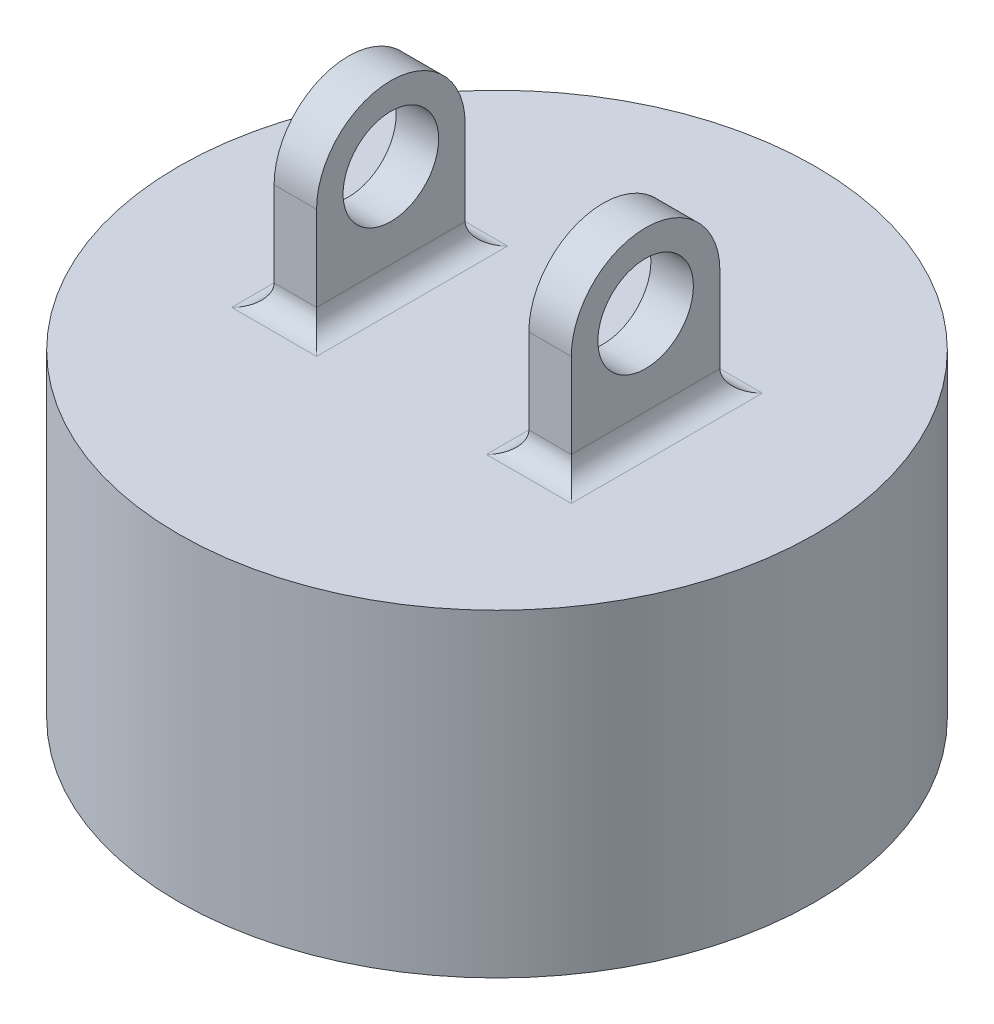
from build123d import *

# Parameters (mm, degrees)
SKETCH1_R           = 150
BOSS_EXTRUDE1_DEPTH = 150
SKETCH2_R           = 75
CUT_EXTRUDE1_DEPTH  = 100
SKETCH3_R           = 22.5
BOSS_EXTRUDE3_DEPTH = 20
FILLET1_R           = 10


with BuildPart() as part:
    # Sketch1 → Boss-Extrude1 (new body)
    with BuildSketch(Plane(origin=(0, 0, 0), x_dir=(1, 0, 0), z_dir=(0, 1, 0))):
        with Locations(Location((0, 0, 0), (0, 0, 270))):
            Circle(SKETCH1_R)
    extrude(amount=BOSS_EXTRUDE1_DEPTH)

    # Sketch2 → Cut-Extrude1 (cut)
    with BuildSketch(Plane.XZ):
        with Locations(Location((0, 0, 0), (0, 0, 270))):
            Circle(SKETCH2_R)
    extrude(amount=-CUT_EXTRUDE1_DEPTH, mode=Mode.SUBTRACT)

    # Sketch3 → Boss-Extrude3 (add)
    with BuildSketch(Plane(origin=(50, 0, 0), x_dir=(0, 0, -1), z_dir=(1, 0, 0))):
        with BuildLine():
            Line((-35, 150), (-35, 200))
            ThreePointArc((-35, 200), (0, 235), (35, 200))
            Line((35, 200), (35, 150))
            Line((35, 150), (-35, 150))
        make_face()
        with Locations((0, 200)):
            Circle(SKETCH3_R, mode=Mode.SUBTRACT)
    boss_extrude3 = extrude(amount=BOSS_EXTRUDE3_DEPTH)

    # Mirror1: Boss-Extrude3 across plane
    add(boss_extrude3.mirror(Plane(origin=(0, 0, 0), x_dir=(0, 0, 1), z_dir=(1, 0, 0))))

    # Fillet1
    fillet1_edges = [part.edges().sort_by_distance(p)[0] for p in [
        (70, 150, 0),
        (50, 150, 0),
        (60, 150, 35),
        (60, 150, -35),
        (-70, 150, 0),
        (-60, 150, -35),
        (-60, 150, 35),
        (-50, 150, 0),
    ]]
    fillet(fillet1_edges, radius=FILLET1_R)


solid = part.part
